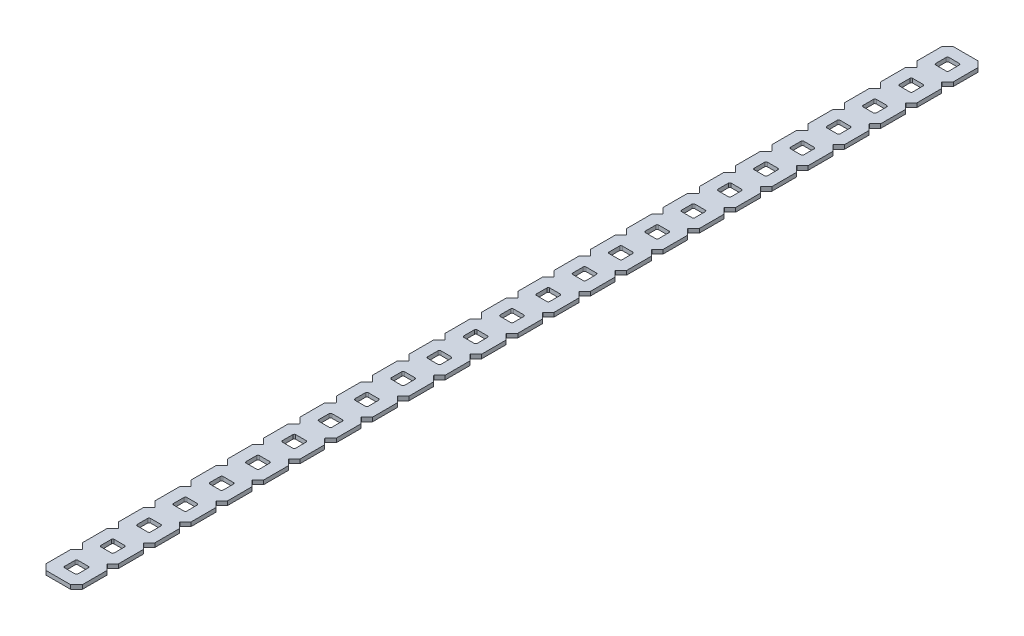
from build123d import *

# Parameters (mm, degrees)
BOSS_EXTRUDE1_DEPTH = 1.4224


with BuildPart() as part:
    # Sketch1 → Boss-Extrude1 (new body)
    with BuildSketch(Plane.XZ):
        with BuildLine():
            Line((12.7, -302.773014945), (12.7, -294.126985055))
            Line((12.7, -294.126985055), (10.762817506, -292.189802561))
            ThreePointArc((10.762817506, -292.189802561), (10.725620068, -292.1), (10.762817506, -292.010197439))
            Line((10.762817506, -292.010197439), (12.7, -290.073014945))
            Line((12.7, -290.073014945), (12.7, -281.426985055))
            Line((12.7, -281.426985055), (10.762817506, -279.489802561))
            ThreePointArc((10.762817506, -279.489802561), (10.725620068, -279.4), (10.762817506, -279.310197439))
            Line((10.762817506, -279.310197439), (12.7, -277.373014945))
            Line((12.7, -277.373014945), (12.7, -268.726985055))
            Line((12.7, -268.726985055), (10.762817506, -266.789802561))
            ThreePointArc((10.762817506, -266.789802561), (10.725620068, -266.7), (10.762817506, -266.610197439))
            Line((10.762817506, -266.610197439), (12.7, -264.673014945))
            Line((12.7, -264.673014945), (12.7, -256.026985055))
            Line((12.7, -256.026985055), (10.762817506, -254.089802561))
            ThreePointArc((10.762817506, -254.089802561), (10.725620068, -254), (10.762817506, -253.910197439))
            Line((10.762817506, -253.910197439), (12.7, -251.973014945))
            Line((12.7, -251.973014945), (12.7, -243.326985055))
            Line((12.7, -243.326985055), (10.762817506, -241.389802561))
            ThreePointArc((10.762817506, -241.389802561), (10.725620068, -241.3), (10.762817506, -241.210197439))
            Line((10.762817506, -241.210197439), (12.7, -239.273014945))
            Line((12.7, -239.273014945), (12.7, -230.626985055))
            Line((12.7, -230.626985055), (10.762817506, -228.689802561))
            ThreePointArc((10.762817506, -228.689802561), (10.725620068, -228.6), (10.762817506, -228.510197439))
            Line((10.762817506, -228.510197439), (12.7, -226.573014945))
            Line((12.7, -226.573014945), (12.7, -217.926985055))
            Line((12.7, -217.926985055), (10.762817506, -215.989802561))
            ThreePointArc((10.762817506, -215.989802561), (10.725620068, -215.9), (10.762817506, -215.810197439))
            Line((10.762817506, -215.810197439), (12.7, -213.873014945))
            Line((12.7, -213.873014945), (12.7, -205.226985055))
            Line((12.7, -205.226985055), (10.762817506, -203.289802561))
            ThreePointArc((10.762817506, -203.289802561), (10.725620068, -203.2), (10.762817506, -203.110197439))
            Line((10.762817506, -203.110197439), (12.7, -201.173014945))
            Line((12.7, -201.173014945), (12.7, -192.526985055))
            Line((12.7, -192.526985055), (10.762817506, -190.589802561))
            ThreePointArc((10.762817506, -190.589802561), (10.725620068, -190.5), (10.762817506, -190.410197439))
            Line((10.762817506, -190.410197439), (12.7, -188.473014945))
            Line((12.7, -188.473014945), (12.7, -179.826985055))
            Line((12.7, -179.826985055), (10.762817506, -177.889802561))
            ThreePointArc((10.762817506, -177.889802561), (10.725620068, -177.8), (10.762817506, -177.710197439))
            Line((10.762817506, -177.710197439), (12.7, -175.773014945))
            Line((12.7, -175.773014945), (12.7, -167.126985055))
            Line((12.7, -167.126985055), (10.762817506, -165.189802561))
            ThreePointArc((10.762817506, -165.189802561), (10.725620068, -165.1), (10.762817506, -165.010197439))
            Line((10.762817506, -165.010197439), (12.7, -163.073014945))
            Line((12.7, -163.073014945), (12.7, -154.426985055))
            Line((12.7, -154.426985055), (10.762817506, -152.489802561))
            ThreePointArc((10.762817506, -152.489802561), (10.725620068, -152.4), (10.762817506, -152.310197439))
            Line((10.762817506, -152.310197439), (12.7, -150.373014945))
            Line((12.7, -150.373014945), (12.7, -141.726985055))
            Line((12.7, -141.726985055), (10.762817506, -139.789802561))
            ThreePointArc((10.762817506, -139.789802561), (10.725620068, -139.7), (10.762817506, -139.610197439))
            Line((10.762817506, -139.610197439), (12.7, -137.673014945))
            Line((12.7, -137.673014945), (12.7, -129.026985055))
            Line((12.7, -129.026985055), (10.762817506, -127.089802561))
            ThreePointArc((10.762817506, -127.089802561), (10.725620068, -127), (10.762817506, -126.910197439))
            Line((10.762817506, -126.910197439), (12.7, -124.973014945))
            Line((12.7, -124.973014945), (12.7, -116.326985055))
            Line((12.7, -116.326985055), (10.762817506, -114.389802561))
            ThreePointArc((10.762817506, -114.389802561), (10.725620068, -114.3), (10.762817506, -114.210197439))
            Line((10.762817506, -114.210197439), (12.7, -112.273014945))
            Line((12.7, -112.273014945), (12.7, -103.626985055))
            Line((12.7, -103.626985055), (10.762817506, -101.689802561))
            ThreePointArc((10.762817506, -101.689802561), (10.725620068, -101.6), (10.762817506, -101.510197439))
            Line((10.762817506, -101.510197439), (12.7, -99.573014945))
            Line((12.7, -99.573014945), (12.7, -90.926985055))
            Line((12.7, -90.926985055), (10.762817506, -88.989802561))
            ThreePointArc((10.762817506, -88.989802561), (10.725620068, -88.9), (10.762817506, -88.810197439))
            Line((10.762817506, -88.810197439), (12.7, -86.873014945))
            Line((12.7, -86.873014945), (12.7, -78.226985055))
            Line((12.7, -78.226985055), (10.762817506, -76.289802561))
            ThreePointArc((10.762817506, -76.289802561), (10.725620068, -76.2), (10.762817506, -76.110197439))
            Line((10.762817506, -76.110197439), (12.7, -74.173014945))
            Line((12.7, -74.173014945), (12.7, -65.526985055))
            Line((12.7, -65.526985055), (10.762817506, -63.589802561))
            ThreePointArc((10.762817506, -63.589802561), (10.725620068, -63.5), (10.762817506, -63.410197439))
            Line((10.762817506, -63.410197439), (12.7, -61.473014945))
            Line((12.7, -61.473014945), (12.7, -52.826985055))
            Line((12.7, -52.826985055), (10.762817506, -50.889802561))
            ThreePointArc((10.762817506, -50.889802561), (10.725620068, -50.8), (10.762817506, -50.710197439))
            Line((10.762817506, -50.710197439), (12.7, -48.773014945))
            Line((12.7, -48.773014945), (12.7, -40.126985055))
            Line((12.7, -40.126985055), (10.762817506, -38.189802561))
            ThreePointArc((10.762817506, -38.189802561), (10.725620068, -38.1), (10.762817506, -38.010197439))
            Line((10.762817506, -38.010197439), (12.7, -36.073014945))
            Line((12.7, -36.073014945), (12.7, -27.426985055))
            Line((12.7, -27.426985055), (10.762817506, -25.489802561))
            ThreePointArc((10.762817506, -25.489802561), (10.725620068, -25.4), (10.762817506, -25.310197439))
            Line((10.762817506, -25.310197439), (12.7, -23.373014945))
            Line((12.7, -23.373014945), (12.7, -14.726985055))
            Line((12.7, -14.726985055), (10.762817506, -12.789802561))
            ThreePointArc((10.762817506, -12.789802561), (10.725620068, -12.7), (10.762817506, -12.610197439))
            Line((10.762817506, -12.610197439), (12.7, -10.673014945))
            Line((12.7, -10.673014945), (12.7, -2.032))
            Line((12.7, -2.032), (10.668, 0))
            Line((10.668, 0), (2.032, 0))
            Line((2.032, 0), (0, -2.032))
            Line((0, -2.032), (0, -10.673014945))
            Line((0, -10.673014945), (1.937182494, -12.610197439))
            ThreePointArc((1.937182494, -12.610197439), (1.974379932, -12.7), (1.937182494, -12.789802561))
            Line((1.937182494, -12.789802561), (0, -14.726985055))
            Line((0, -14.726985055), (0, -23.373014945))
            Line((0, -23.373014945), (1.937182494, -25.310197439))
            ThreePointArc((1.937182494, -25.310197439), (1.974379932, -25.4), (1.937182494, -25.489802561))
            Line((1.937182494, -25.489802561), (0, -27.426985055))
            Line((0, -27.426985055), (0, -36.073014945))
            Line((0, -36.073014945), (1.937182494, -38.010197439))
            ThreePointArc((1.937182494, -38.010197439), (1.974379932, -38.1), (1.937182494, -38.189802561))
            Line((1.937182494, -38.189802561), (0, -40.126985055))
            Line((0, -40.126985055), (0, -48.773014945))
            Line((0, -48.773014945), (1.937182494, -50.710197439))
            ThreePointArc((1.937182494, -50.710197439), (1.974379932, -50.8), (1.937182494, -50.889802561))
            Line((1.937182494, -50.889802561), (0, -52.826985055))
            Line((0, -52.826985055), (0, -61.473014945))
            Line((0, -61.473014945), (1.937182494, -63.410197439))
            ThreePointArc((1.937182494, -63.410197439), (1.974379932, -63.5), (1.937182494, -63.589802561))
            Line((1.937182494, -63.589802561), (0, -65.526985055))
            Line((0, -65.526985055), (0, -74.173014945))
            Line((0, -74.173014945), (1.937182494, -76.110197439))
            ThreePointArc((1.937182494, -76.110197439), (1.974379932, -76.2), (1.937182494, -76.289802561))
            Line((1.937182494, -76.289802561), (0, -78.226985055))
            Line((0, -78.226985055), (0, -86.873014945))
            Line((0, -86.873014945), (1.937182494, -88.810197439))
            ThreePointArc((1.937182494, -88.810197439), (1.974379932, -88.9), (1.937182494, -88.989802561))
            Line((1.937182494, -88.989802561), (0, -90.926985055))
            Line((0, -90.926985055), (0, -99.573014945))
            Line((0, -99.573014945), (1.937182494, -101.510197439))
            ThreePointArc((1.937182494, -101.510197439), (1.974379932, -101.6), (1.937182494, -101.689802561))
            Line((1.937182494, -101.689802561), (0, -103.626985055))
            Line((0, -103.626985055), (0, -112.273014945))
            Line((0, -112.273014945), (1.937182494, -114.210197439))
            ThreePointArc((1.937182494, -114.210197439), (1.974379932, -114.3), (1.937182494, -114.389802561))
            Line((1.937182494, -114.389802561), (0, -116.326985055))
            Line((0, -116.326985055), (0, -124.973014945))
            Line((0, -124.973014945), (1.937182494, -126.910197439))
            ThreePointArc((1.937182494, -126.910197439), (1.974379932, -127), (1.937182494, -127.089802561))
            Line((1.937182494, -127.089802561), (0, -129.026985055))
            Line((0, -129.026985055), (0, -137.673014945))
            Line((0, -137.673014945), (1.937182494, -139.610197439))
            ThreePointArc((1.937182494, -139.610197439), (1.974379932, -139.7), (1.937182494, -139.789802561))
            Line((1.937182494, -139.789802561), (0, -141.726985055))
            Line((0, -141.726985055), (0, -150.373014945))
            Line((0, -150.373014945), (1.937182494, -152.310197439))
            ThreePointArc((1.937182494, -152.310197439), (1.974379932, -152.4), (1.937182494, -152.489802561))
            Line((1.937182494, -152.489802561), (0, -154.426985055))
            Line((0, -154.426985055), (0, -163.073014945))
            Line((0, -163.073014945), (1.937182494, -165.010197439))
            ThreePointArc((1.937182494, -165.010197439), (1.974379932, -165.1), (1.937182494, -165.189802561))
            Line((1.937182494, -165.189802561), (0, -167.126985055))
            Line((0, -167.126985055), (0, -175.773014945))
            Line((0, -175.773014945), (1.937182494, -177.710197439))
            ThreePointArc((1.937182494, -177.710197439), (1.974379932, -177.8), (1.937182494, -177.889802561))
            Line((1.937182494, -177.889802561), (0, -179.826985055))
            Line((0, -179.826985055), (0, -188.473014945))
            Line((0, -188.473014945), (1.937182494, -190.410197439))
            ThreePointArc((1.937182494, -190.410197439), (1.974379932, -190.5), (1.937182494, -190.589802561))
            Line((1.937182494, -190.589802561), (0, -192.526985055))
            Line((0, -192.526985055), (0, -201.173014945))
            Line((0, -201.173014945), (1.937182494, -203.110197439))
            ThreePointArc((1.937182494, -203.110197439), (1.974379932, -203.2), (1.937182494, -203.289802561))
            Line((1.937182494, -203.289802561), (0, -205.226985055))
            Line((0, -205.226985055), (0, -213.873014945))
            Line((0, -213.873014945), (1.937182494, -215.810197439))
            ThreePointArc((1.937182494, -215.810197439), (1.974379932, -215.9), (1.937182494, -215.989802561))
            Line((1.937182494, -215.989802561), (0, -217.926985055))
            Line((0, -217.926985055), (0, -226.573014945))
            Line((0, -226.573014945), (1.937182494, -228.510197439))
            ThreePointArc((1.937182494, -228.510197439), (1.974379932, -228.6), (1.937182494, -228.689802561))
            Line((1.937182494, -228.689802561), (0, -230.626985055))
            Line((0, -230.626985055), (0, -239.273014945))
            Line((0, -239.273014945), (1.937182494, -241.210197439))
            ThreePointArc((1.937182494, -241.210197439), (1.974379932, -241.3), (1.937182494, -241.389802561))
            Line((1.937182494, -241.389802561), (0, -243.326985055))
            Line((0, -243.326985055), (0, -251.973014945))
            Line((0, -251.973014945), (1.937182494, -253.910197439))
            ThreePointArc((1.937182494, -253.910197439), (1.974379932, -254), (1.937182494, -254.089802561))
            Line((1.937182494, -254.089802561), (0, -256.026985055))
            Line((0, -256.026985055), (0, -264.673014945))
            Line((0, -264.673014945), (1.937182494, -266.610197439))
            ThreePointArc((1.937182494, -266.610197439), (1.974379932, -266.7), (1.937182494, -266.789802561))
            Line((1.937182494, -266.789802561), (0, -268.726985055))
            Line((0, -268.726985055), (0, -277.373014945))
            Line((0, -277.373014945), (1.937182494, -279.310197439))
            ThreePointArc((1.937182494, -279.310197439), (1.974379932, -279.4), (1.937182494, -279.489802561))
            Line((1.937182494, -279.489802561), (0, -281.426985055))
            Line((0, -281.426985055), (0, -290.073014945))
            Line((0, -290.073014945), (1.937182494, -292.010197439))
            ThreePointArc((1.937182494, -292.010197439), (1.974379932, -292.1), (1.937182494, -292.189802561))
            Line((1.937182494, -292.189802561), (0, -294.126985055))
            Line((0, -294.126985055), (0, -302.773014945))
            Line((0, -302.773014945), (1.937182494, -304.710197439))
            ThreePointArc((1.937182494, -304.710197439), (1.974379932, -304.8), (1.937182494, -304.889802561))
            Line((1.937182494, -304.889802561), (0, -306.826985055))
            Line((0, -306.826985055), (0, -315.468))
            Line((0, -315.468), (2.032, -317.5))
            Line((2.032, -317.5), (10.668, -317.5))
            Line((10.668, -317.5), (12.7, -315.468))
            Line((12.7, -315.468), (12.7, -306.826985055))
            Line((12.7, -306.826985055), (10.762817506, -304.889802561))
            ThreePointArc((10.762817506, -304.889802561), (10.725620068, -304.8), (10.762817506, -304.710197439))
            Line((10.762817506, -304.710197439), (12.7, -302.773014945))
        make_face()
        with BuildLine():
            Line((4.5466, -308.8386), (8.1534, -308.8386))
            ThreePointArc((8.1534, -308.8386), (8.512610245, -308.987389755), (8.6614, -309.3466))
            Line((8.6614, -309.3466), (8.6614, -312.9534))
            ThreePointArc((8.6614, -312.9534), (8.512610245, -313.312610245), (8.1534, -313.4614))
            Line((8.1534, -313.4614), (4.5466, -313.4614))
            ThreePointArc((4.5466, -313.4614), (4.187389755, -313.312610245), (4.0386, -312.9534))
            Line((4.0386, -312.9534), (4.0386, -309.3466))
            ThreePointArc((4.0386, -309.3466), (4.187389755, -308.987389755), (4.5466, -308.8386))
        make_face(mode=Mode.SUBTRACT)
        with BuildLine():
            Line((4.5466, -296.1386), (8.1534, -296.1386))
            ThreePointArc((8.1534, -296.1386), (8.512610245, -296.287389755), (8.6614, -296.6466))
            Line((8.6614, -296.6466), (8.6614, -300.2534))
            ThreePointArc((8.6614, -300.2534), (8.512610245, -300.612610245), (8.1534, -300.7614))
            Line((8.1534, -300.7614), (4.5466, -300.7614))
            ThreePointArc((4.5466, -300.7614), (4.187389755, -300.612610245), (4.0386, -300.2534))
            Line((4.0386, -300.2534), (4.0386, -296.6466))
            ThreePointArc((4.0386, -296.6466), (4.187389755, -296.287389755), (4.5466, -296.1386))
        make_face(mode=Mode.SUBTRACT)
        with BuildLine():
            Line((4.5466, -283.4386), (8.1534, -283.4386))
            ThreePointArc((8.1534, -283.4386), (8.512610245, -283.587389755), (8.6614, -283.9466))
            Line((8.6614, -283.9466), (8.6614, -287.5534))
            ThreePointArc((8.6614, -287.5534), (8.512610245, -287.912610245), (8.1534, -288.0614))
            Line((8.1534, -288.0614), (4.5466, -288.0614))
            ThreePointArc((4.5466, -288.0614), (4.187389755, -287.912610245), (4.0386, -287.5534))
            Line((4.0386, -287.5534), (4.0386, -283.9466))
            ThreePointArc((4.0386, -283.9466), (4.187389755, -283.587389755), (4.5466, -283.4386))
        make_face(mode=Mode.SUBTRACT)
        with BuildLine():
            Line((4.5466, -270.7386), (8.1534, -270.7386))
            ThreePointArc((8.1534, -270.7386), (8.512610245, -270.887389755), (8.6614, -271.2466))
            Line((8.6614, -271.2466), (8.6614, -274.8534))
            ThreePointArc((8.6614, -274.8534), (8.512610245, -275.212610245), (8.1534, -275.3614))
            Line((8.1534, -275.3614), (4.5466, -275.3614))
            ThreePointArc((4.5466, -275.3614), (4.187389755, -275.212610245), (4.0386, -274.8534))
            Line((4.0386, -274.8534), (4.0386, -271.2466))
            ThreePointArc((4.0386, -271.2466), (4.187389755, -270.887389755), (4.5466, -270.7386))
        make_face(mode=Mode.SUBTRACT)
        with BuildLine():
            Line((4.5466, -258.0386), (8.1534, -258.0386))
            ThreePointArc((8.1534, -258.0386), (8.512610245, -258.187389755), (8.6614, -258.5466))
            Line((8.6614, -258.5466), (8.6614, -262.1534))
            ThreePointArc((8.6614, -262.1534), (8.512610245, -262.512610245), (8.1534, -262.6614))
            Line((8.1534, -262.6614), (4.5466, -262.6614))
            ThreePointArc((4.5466, -262.6614), (4.187389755, -262.512610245), (4.0386, -262.1534))
            Line((4.0386, -262.1534), (4.0386, -258.5466))
            ThreePointArc((4.0386, -258.5466), (4.187389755, -258.187389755), (4.5466, -258.0386))
        make_face(mode=Mode.SUBTRACT)
        with BuildLine():
            Line((4.5466, -245.3386), (8.1534, -245.3386))
            ThreePointArc((8.1534, -245.3386), (8.512610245, -245.487389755), (8.6614, -245.8466))
            Line((8.6614, -245.8466), (8.6614, -249.4534))
            ThreePointArc((8.6614, -249.4534), (8.512610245, -249.812610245), (8.1534, -249.9614))
            Line((8.1534, -249.9614), (4.5466, -249.9614))
            ThreePointArc((4.5466, -249.9614), (4.187389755, -249.812610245), (4.0386, -249.4534))
            Line((4.0386, -249.4534), (4.0386, -245.8466))
            ThreePointArc((4.0386, -245.8466), (4.187389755, -245.487389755), (4.5466, -245.3386))
        make_face(mode=Mode.SUBTRACT)
        with BuildLine():
            Line((4.5466, -232.6386), (8.1534, -232.6386))
            ThreePointArc((8.1534, -232.6386), (8.512610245, -232.787389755), (8.6614, -233.1466))
            Line((8.6614, -233.1466), (8.6614, -236.7534))
            ThreePointArc((8.6614, -236.7534), (8.512610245, -237.112610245), (8.1534, -237.2614))
            Line((8.1534, -237.2614), (4.5466, -237.2614))
            ThreePointArc((4.5466, -237.2614), (4.187389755, -237.112610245), (4.0386, -236.7534))
            Line((4.0386, -236.7534), (4.0386, -233.1466))
            ThreePointArc((4.0386, -233.1466), (4.187389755, -232.787389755), (4.5466, -232.6386))
        make_face(mode=Mode.SUBTRACT)
        with BuildLine():
            Line((4.5466, -219.9386), (8.1534, -219.9386))
            ThreePointArc((8.1534, -219.9386), (8.512610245, -220.087389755), (8.6614, -220.4466))
            Line((8.6614, -220.4466), (8.6614, -224.0534))
            ThreePointArc((8.6614, -224.0534), (8.512610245, -224.412610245), (8.1534, -224.5614))
            Line((8.1534, -224.5614), (4.5466, -224.5614))
            ThreePointArc((4.5466, -224.5614), (4.187389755, -224.412610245), (4.0386, -224.0534))
            Line((4.0386, -224.0534), (4.0386, -220.4466))
            ThreePointArc((4.0386, -220.4466), (4.187389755, -220.087389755), (4.5466, -219.9386))
        make_face(mode=Mode.SUBTRACT)
        with BuildLine():
            Line((4.5466, -207.2386), (8.1534, -207.2386))
            ThreePointArc((8.1534, -207.2386), (8.512610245, -207.387389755), (8.6614, -207.7466))
            Line((8.6614, -207.7466), (8.6614, -211.3534))
            ThreePointArc((8.6614, -211.3534), (8.512610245, -211.712610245), (8.1534, -211.8614))
            Line((8.1534, -211.8614), (4.5466, -211.8614))
            ThreePointArc((4.5466, -211.8614), (4.187389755, -211.712610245), (4.0386, -211.3534))
            Line((4.0386, -211.3534), (4.0386, -207.7466))
            ThreePointArc((4.0386, -207.7466), (4.187389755, -207.387389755), (4.5466, -207.2386))
        make_face(mode=Mode.SUBTRACT)
        with BuildLine():
            Line((4.5466, -194.5386), (8.1534, -194.5386))
            ThreePointArc((8.1534, -194.5386), (8.512610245, -194.687389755), (8.6614, -195.0466))
            Line((8.6614, -195.0466), (8.6614, -198.6534))
            ThreePointArc((8.6614, -198.6534), (8.512610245, -199.012610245), (8.1534, -199.1614))
            Line((8.1534, -199.1614), (4.5466, -199.1614))
            ThreePointArc((4.5466, -199.1614), (4.187389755, -199.012610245), (4.0386, -198.6534))
            Line((4.0386, -198.6534), (4.0386, -195.0466))
            ThreePointArc((4.0386, -195.0466), (4.187389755, -194.687389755), (4.5466, -194.5386))
        make_face(mode=Mode.SUBTRACT)
        with BuildLine():
            Line((4.5466, -181.8386), (8.1534, -181.8386))
            ThreePointArc((8.1534, -181.8386), (8.512610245, -181.987389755), (8.6614, -182.3466))
            Line((8.6614, -182.3466), (8.6614, -185.9534))
            ThreePointArc((8.6614, -185.9534), (8.512610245, -186.312610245), (8.1534, -186.4614))
            Line((8.1534, -186.4614), (4.5466, -186.4614))
            ThreePointArc((4.5466, -186.4614), (4.187389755, -186.312610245), (4.0386, -185.9534))
            Line((4.0386, -185.9534), (4.0386, -182.3466))
            ThreePointArc((4.0386, -182.3466), (4.187389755, -181.987389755), (4.5466, -181.8386))
        make_face(mode=Mode.SUBTRACT)
        with BuildLine():
            Line((4.5466, -169.1386), (8.1534, -169.1386))
            ThreePointArc((8.1534, -169.1386), (8.512610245, -169.287389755), (8.6614, -169.6466))
            Line((8.6614, -169.6466), (8.6614, -173.2534))
            ThreePointArc((8.6614, -173.2534), (8.512610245, -173.612610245), (8.1534, -173.7614))
            Line((8.1534, -173.7614), (4.5466, -173.7614))
            ThreePointArc((4.5466, -173.7614), (4.187389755, -173.612610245), (4.0386, -173.2534))
            Line((4.0386, -173.2534), (4.0386, -169.6466))
            ThreePointArc((4.0386, -169.6466), (4.187389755, -169.287389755), (4.5466, -169.1386))
        make_face(mode=Mode.SUBTRACT)
        with BuildLine():
            Line((4.5466, -156.4386), (8.1534, -156.4386))
            ThreePointArc((8.1534, -156.4386), (8.512610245, -156.587389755), (8.6614, -156.9466))
            Line((8.6614, -156.9466), (8.6614, -160.5534))
            ThreePointArc((8.6614, -160.5534), (8.512610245, -160.912610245), (8.1534, -161.0614))
            Line((8.1534, -161.0614), (4.5466, -161.0614))
            ThreePointArc((4.5466, -161.0614), (4.187389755, -160.912610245), (4.0386, -160.5534))
            Line((4.0386, -160.5534), (4.0386, -156.9466))
            ThreePointArc((4.0386, -156.9466), (4.187389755, -156.587389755), (4.5466, -156.4386))
        make_face(mode=Mode.SUBTRACT)
        with BuildLine():
            Line((4.5466, -143.7386), (8.1534, -143.7386))
            ThreePointArc((8.1534, -143.7386), (8.512610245, -143.887389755), (8.6614, -144.2466))
            Line((8.6614, -144.2466), (8.6614, -147.8534))
            ThreePointArc((8.6614, -147.8534), (8.512610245, -148.212610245), (8.1534, -148.3614))
            Line((8.1534, -148.3614), (4.5466, -148.3614))
            ThreePointArc((4.5466, -148.3614), (4.187389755, -148.212610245), (4.0386, -147.8534))
            Line((4.0386, -147.8534), (4.0386, -144.2466))
            ThreePointArc((4.0386, -144.2466), (4.187389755, -143.887389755), (4.5466, -143.7386))
        make_face(mode=Mode.SUBTRACT)
        with BuildLine():
            Line((4.5466, -131.0386), (8.1534, -131.0386))
            ThreePointArc((8.1534, -131.0386), (8.512610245, -131.187389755), (8.6614, -131.5466))
            Line((8.6614, -131.5466), (8.6614, -135.1534))
            ThreePointArc((8.6614, -135.1534), (8.512610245, -135.512610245), (8.1534, -135.6614))
            Line((8.1534, -135.6614), (4.5466, -135.6614))
            ThreePointArc((4.5466, -135.6614), (4.187389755, -135.512610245), (4.0386, -135.1534))
            Line((4.0386, -135.1534), (4.0386, -131.5466))
            ThreePointArc((4.0386, -131.5466), (4.187389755, -131.187389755), (4.5466, -131.0386))
        make_face(mode=Mode.SUBTRACT)
        with BuildLine():
            Line((4.5466, -118.3386), (8.1534, -118.3386))
            ThreePointArc((8.1534, -118.3386), (8.512610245, -118.487389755), (8.6614, -118.8466))
            Line((8.6614, -118.8466), (8.6614, -122.4534))
            ThreePointArc((8.6614, -122.4534), (8.512610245, -122.812610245), (8.1534, -122.9614))
            Line((8.1534, -122.9614), (4.5466, -122.9614))
            ThreePointArc((4.5466, -122.9614), (4.187389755, -122.812610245), (4.0386, -122.4534))
            Line((4.0386, -122.4534), (4.0386, -118.8466))
            ThreePointArc((4.0386, -118.8466), (4.187389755, -118.487389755), (4.5466, -118.3386))
        make_face(mode=Mode.SUBTRACT)
        with BuildLine():
            Line((4.5466, -105.6386), (8.1534, -105.6386))
            ThreePointArc((8.1534, -105.6386), (8.512610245, -105.787389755), (8.6614, -106.1466))
            Line((8.6614, -106.1466), (8.6614, -109.7534))
            ThreePointArc((8.6614, -109.7534), (8.512610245, -110.112610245), (8.1534, -110.2614))
            Line((8.1534, -110.2614), (4.5466, -110.2614))
            ThreePointArc((4.5466, -110.2614), (4.187389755, -110.112610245), (4.0386, -109.7534))
            Line((4.0386, -109.7534), (4.0386, -106.1466))
            ThreePointArc((4.0386, -106.1466), (4.187389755, -105.787389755), (4.5466, -105.6386))
        make_face(mode=Mode.SUBTRACT)
        with BuildLine():
            Line((4.5466, -92.9386), (8.1534, -92.9386))
            ThreePointArc((8.1534, -92.9386), (8.512610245, -93.087389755), (8.6614, -93.4466))
            Line((8.6614, -93.4466), (8.6614, -97.0534))
            ThreePointArc((8.6614, -97.0534), (8.512610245, -97.412610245), (8.1534, -97.5614))
            Line((8.1534, -97.5614), (4.5466, -97.5614))
            ThreePointArc((4.5466, -97.5614), (4.187389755, -97.412610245), (4.0386, -97.0534))
            Line((4.0386, -97.0534), (4.0386, -93.4466))
            ThreePointArc((4.0386, -93.4466), (4.187389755, -93.087389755), (4.5466, -92.9386))
        make_face(mode=Mode.SUBTRACT)
        with BuildLine():
            Line((4.5466, -80.2386), (8.1534, -80.2386))
            ThreePointArc((8.1534, -80.2386), (8.512610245, -80.387389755), (8.6614, -80.7466))
            Line((8.6614, -80.7466), (8.6614, -84.3534))
            ThreePointArc((8.6614, -84.3534), (8.512610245, -84.712610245), (8.1534, -84.8614))
            Line((8.1534, -84.8614), (4.5466, -84.8614))
            ThreePointArc((4.5466, -84.8614), (4.187389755, -84.712610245), (4.0386, -84.3534))
            Line((4.0386, -84.3534), (4.0386, -80.7466))
            ThreePointArc((4.0386, -80.7466), (4.187389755, -80.387389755), (4.5466, -80.2386))
        make_face(mode=Mode.SUBTRACT)
        with BuildLine():
            Line((4.5466, -67.5386), (8.1534, -67.5386))
            ThreePointArc((8.1534, -67.5386), (8.512610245, -67.687389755), (8.6614, -68.0466))
            Line((8.6614, -68.0466), (8.6614, -71.6534))
            ThreePointArc((8.6614, -71.6534), (8.512610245, -72.012610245), (8.1534, -72.1614))
            Line((8.1534, -72.1614), (4.5466, -72.1614))
            ThreePointArc((4.5466, -72.1614), (4.187389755, -72.012610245), (4.0386, -71.6534))
            Line((4.0386, -71.6534), (4.0386, -68.0466))
            ThreePointArc((4.0386, -68.0466), (4.187389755, -67.687389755), (4.5466, -67.5386))
        make_face(mode=Mode.SUBTRACT)
        with BuildLine():
            Line((4.5466, -54.8386), (8.1534, -54.8386))
            ThreePointArc((8.1534, -54.8386), (8.512610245, -54.987389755), (8.6614, -55.3466))
            Line((8.6614, -55.3466), (8.6614, -58.9534))
            ThreePointArc((8.6614, -58.9534), (8.512610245, -59.312610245), (8.1534, -59.4614))
            Line((8.1534, -59.4614), (4.5466, -59.4614))
            ThreePointArc((4.5466, -59.4614), (4.187389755, -59.312610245), (4.0386, -58.9534))
            Line((4.0386, -58.9534), (4.0386, -55.3466))
            ThreePointArc((4.0386, -55.3466), (4.187389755, -54.987389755), (4.5466, -54.8386))
        make_face(mode=Mode.SUBTRACT)
        with BuildLine():
            Line((4.5466, -42.1386), (8.1534, -42.1386))
            ThreePointArc((8.1534, -42.1386), (8.512610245, -42.287389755), (8.6614, -42.6466))
            Line((8.6614, -42.6466), (8.6614, -46.2534))
            ThreePointArc((8.6614, -46.2534), (8.512610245, -46.612610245), (8.1534, -46.7614))
            Line((8.1534, -46.7614), (4.5466, -46.7614))
            ThreePointArc((4.5466, -46.7614), (4.187389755, -46.612610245), (4.0386, -46.2534))
            Line((4.0386, -46.2534), (4.0386, -42.6466))
            ThreePointArc((4.0386, -42.6466), (4.187389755, -42.287389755), (4.5466, -42.1386))
        make_face(mode=Mode.SUBTRACT)
        with BuildLine():
            Line((4.5466, -29.4386), (8.1534, -29.4386))
            ThreePointArc((8.1534, -29.4386), (8.512610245, -29.587389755), (8.6614, -29.9466))
            Line((8.6614, -29.9466), (8.6614, -33.5534))
            ThreePointArc((8.6614, -33.5534), (8.512610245, -33.912610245), (8.1534, -34.0614))
            Line((8.1534, -34.0614), (4.5466, -34.0614))
            ThreePointArc((4.5466, -34.0614), (4.187389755, -33.912610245), (4.0386, -33.5534))
            Line((4.0386, -33.5534), (4.0386, -29.9466))
            ThreePointArc((4.0386, -29.9466), (4.187389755, -29.587389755), (4.5466, -29.4386))
        make_face(mode=Mode.SUBTRACT)
        with BuildLine():
            Line((8.1534, -8.6614), (4.5466, -8.6614))
            ThreePointArc((4.5466, -8.6614), (4.187389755, -8.512610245), (4.0386, -8.1534))
            Line((4.0386, -8.1534), (4.0386, -4.5466))
            ThreePointArc((4.0386, -4.5466), (4.187389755, -4.187389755), (4.5466, -4.0386))
            Line((4.5466, -4.0386), (8.1534, -4.0386))
            ThreePointArc((8.1534, -4.0386), (8.512610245, -4.187389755), (8.6614, -4.5466))
            Line((8.6614, -4.5466), (8.6614, -8.1534))
            ThreePointArc((8.6614, -8.1534), (8.512610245, -8.512610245), (8.1534, -8.6614))
        make_face(mode=Mode.SUBTRACT)
        with BuildLine():
            Line((4.0386, -20.8534), (4.0386, -17.2466))
            ThreePointArc((4.0386, -17.2466), (4.187389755, -16.887389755), (4.5466, -16.7386))
            Line((4.5466, -16.7386), (8.1534, -16.7386))
            ThreePointArc((8.1534, -16.7386), (8.512610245, -16.887389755), (8.6614, -17.2466))
            Line((8.6614, -17.2466), (8.6614, -20.8534))
            ThreePointArc((8.6614, -20.8534), (8.512610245, -21.212610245), (8.1534, -21.3614))
            Line((8.1534, -21.3614), (4.5466, -21.3614))
            ThreePointArc((4.5466, -21.3614), (4.187389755, -21.212610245), (4.0386, -20.8534))
        make_face(mode=Mode.SUBTRACT)
    extrude(amount=-BOSS_EXTRUDE1_DEPTH)


solid = part.part
